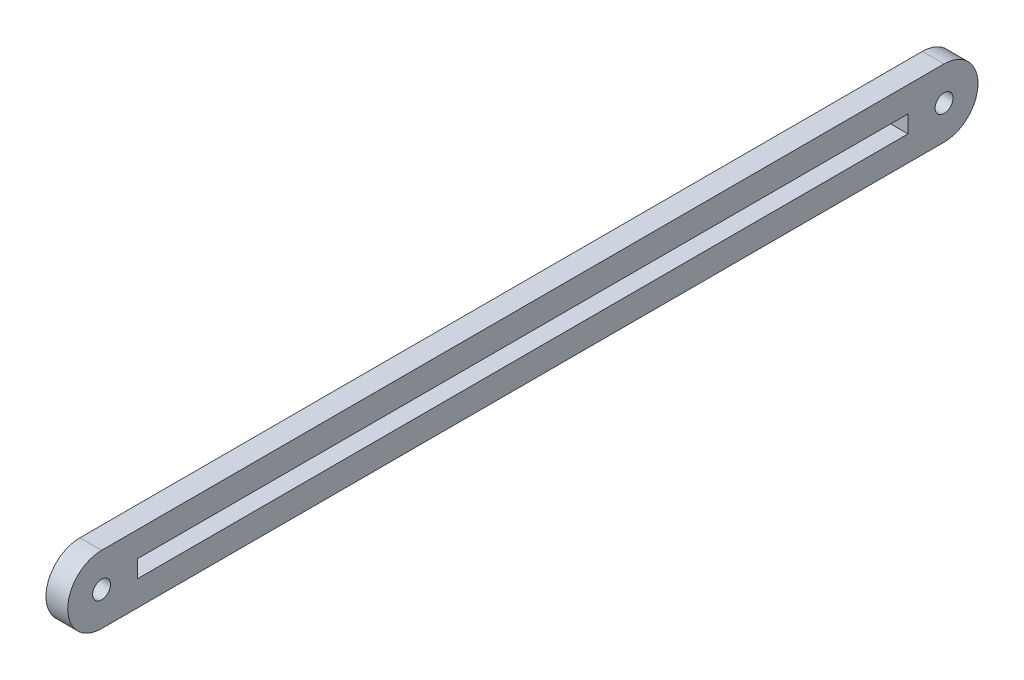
from build123d import *

# Parameters (mm, degrees)
CROQUIS1_R              = 1.65
CROQUIS1_W              = 142
CROQUIS1_H              = 3.2
SALIENTE_EXTRUIR1_DEPTH = 4


with BuildPart() as part:
    # Croquis1 → Saliente-Extruir1 (new body)
    with BuildSketch(Plane(origin=(0, 0, 0), x_dir=(0, 0, -1), z_dir=(1, 0, 0))):
        with BuildLine():
            Line((-77.65, 6.25), (77.65, 6.25))
            ThreePointArc((77.65, 6.25), (83.9, 0), (77.65, -6.25))
            Line((77.65, -6.25), (-77.65, -6.25))
            ThreePointArc((-77.65, -6.25), (-83.9, 0), (-77.65, 6.25))
        make_face()
        with Locations((-77.65, 0)):
            Circle(CROQUIS1_R, mode=Mode.SUBTRACT)
        with Locations(Location((77.65, 0, 0), (0, 0, 180))):
            Circle(CROQUIS1_R, mode=Mode.SUBTRACT)
        Rectangle(CROQUIS1_W, CROQUIS1_H, mode=Mode.SUBTRACT)
    extrude(amount=SALIENTE_EXTRUIR1_DEPTH)


solid = part.part
